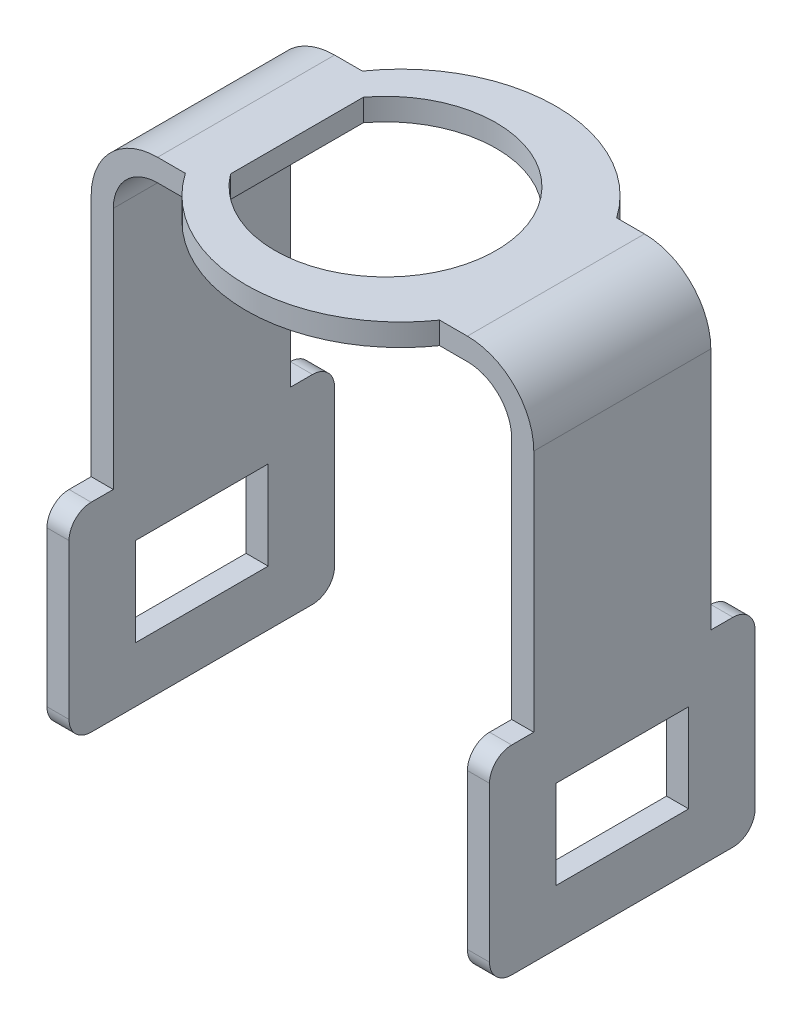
ISO-10303-21;
HEADER;
FILE_DESCRIPTION(('STEP AP214'),'2;1');
FILE_NAME('part.step','',(''),(''),'','','');
FILE_SCHEMA(('AUTOMOTIVE_DESIGN { 1 0 10303 214 1 1 1 1 }'));
ENDSEC;
DATA;
#1=APPLICATION_CONTEXT('core data for automotive mechanical design processes');
#2=APPLICATION_PROTOCOL_DEFINITION('international standard','automotive_design',2000,#1);
#3=PRODUCT_CONTEXT('',#1,'mechanical');
#4=PRODUCT('Part','Part','',(#3));
#5=PRODUCT_RELATED_PRODUCT_CATEGORY('part','',(#4));
#6=PRODUCT_DEFINITION_FORMATION('','',#4);
#7=PRODUCT_DEFINITION_CONTEXT('part definition',#1,'design');
#8=PRODUCT_DEFINITION('design','',#6,#7);
#9=PRODUCT_DEFINITION_SHAPE('','',#8);
#10=(LENGTH_UNIT() NAMED_UNIT(*) SI_UNIT(.MILLI.,.METRE.));
#11=(NAMED_UNIT(*) PLANE_ANGLE_UNIT() SI_UNIT($,.RADIAN.));
#12=(NAMED_UNIT(*) SI_UNIT($,.STERADIAN.) SOLID_ANGLE_UNIT());
#13=UNCERTAINTY_MEASURE_WITH_UNIT(LENGTH_MEASURE(1.E-05),#10,'distance_accuracy_value','');
#14=(GEOMETRIC_REPRESENTATION_CONTEXT(3) GLOBAL_UNCERTAINTY_ASSIGNED_CONTEXT((#13)) GLOBAL_UNIT_ASSIGNED_CONTEXT((#10,
#11,#12)) REPRESENTATION_CONTEXT('',''));
#15=CARTESIAN_POINT('',(0.,0.,0.));
#16=DIRECTION('',(0.,0.,1.));
#17=DIRECTION('',(1.,0.,0.));
#18=AXIS2_PLACEMENT_3D('',#15,#16,#17);
#19=CARTESIAN_POINT('',(-9.00000000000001,-5.,-3.));
#20=DIRECTION('',(0.,0.,-1.));
#21=DIRECTION('',(0.,1.,0.));
#22=AXIS2_PLACEMENT_3D('',#19,#20,#21);
#23=PLANE('',#22);
#24=DIRECTION('',(1.,0.,0.));
#25=VECTOR('',#24,1.);
#26=CARTESIAN_POINT('',(-9.00000000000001,-9.,-3.));
#27=LINE('',#26,#25);
#28=CARTESIAN_POINT('',(-10.,-9.,-3.));
#29=VERTEX_POINT('',#28);
#30=CARTESIAN_POINT('',(-9.00000000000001,-9.,-3.));
#31=VERTEX_POINT('',#30);
#32=EDGE_CURVE('E355',#29,#31,#27,.T.);
#33=ORIENTED_EDGE('',*,*,#32,.T.);
#34=DIRECTION('',(0.,1.,0.));
#35=VECTOR('',#34,1.);
#36=CARTESIAN_POINT('',(-9.00000000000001,8.49999999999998,-3.));
#37=LINE('',#36,#35);
#38=CARTESIAN_POINT('',(-9.00000000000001,-5.,-3.));
#39=VERTEX_POINT('',#38);
#40=EDGE_CURVE('E315',#39,#31,#37,.F.);
#41=ORIENTED_EDGE('',*,*,#40,.F.);
#42=DIRECTION('',(-1.,0.,0.));
#43=VECTOR('',#42,1.);
#44=CARTESIAN_POINT('',(-9.00000000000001,-5.,-3.));
#45=LINE('',#44,#43);
#46=CARTESIAN_POINT('',(-10.,-5.,-3.));
#47=VERTEX_POINT('',#46);
#48=EDGE_CURVE('E347',#39,#47,#45,.T.);
#49=ORIENTED_EDGE('',*,*,#48,.T.);
#50=DIRECTION('',(0.,1.,0.));
#51=VECTOR('',#50,1.);
#52=CARTESIAN_POINT('',(-10.,8.49999999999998,-3.));
#53=LINE('',#52,#51);
#54=EDGE_CURVE('E488',#47,#29,#53,.F.);
#55=ORIENTED_EDGE('',*,*,#54,.T.);
#56=EDGE_LOOP('',(#33,#41,#49,#55));
#57=FACE_BOUND('',#56,.T.);
#58=ADVANCED_FACE('F14',(#57),#23,.F.);
#59=CARTESIAN_POINT('',(-9.00000000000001,-9.,-3.));
#60=DIRECTION('',(0.,-1.,0.));
#61=DIRECTION('',(1.,0.,0.));
#62=AXIS2_PLACEMENT_3D('',#59,#60,#61);
#63=PLANE('',#62);
#64=DIRECTION('',(1.,0.,0.));
#65=VECTOR('',#64,1.);
#66=CARTESIAN_POINT('',(-9.00000000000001,-9.,3.));
#67=LINE('',#66,#65);
#68=CARTESIAN_POINT('',(-10.,-9.,3.));
#69=VERTEX_POINT('',#68);
#70=CARTESIAN_POINT('',(-9.00000000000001,-9.,3.));
#71=VERTEX_POINT('',#70);
#72=EDGE_CURVE('E353',#69,#71,#67,.T.);
#73=ORIENTED_EDGE('',*,*,#72,.T.);
#74=DIRECTION('',(0.,0.,1.));
#75=VECTOR('',#74,1.);
#76=CARTESIAN_POINT('',(-9.00000000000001,-9.,4.));
#77=LINE('',#76,#75);
#78=EDGE_CURVE('E312',#31,#71,#77,.T.);
#79=ORIENTED_EDGE('',*,*,#78,.F.);
#80=ORIENTED_EDGE('',*,*,#32,.F.);
#81=DIRECTION('',(0.,0.,1.));
#82=VECTOR('',#81,1.);
#83=CARTESIAN_POINT('',(-10.,-9.,4.));
#84=LINE('',#83,#82);
#85=EDGE_CURVE('E496',#29,#69,#84,.T.);
#86=ORIENTED_EDGE('',*,*,#85,.T.);
#87=EDGE_LOOP('',(#73,#79,#80,#86));
#88=FACE_BOUND('',#87,.T.);
#89=ADVANCED_FACE('F828',(#88),#63,.F.);
#90=CARTESIAN_POINT('',(-9.00000000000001,-5.,3.));
#91=DIRECTION('',(0.,0.,1.));
#92=DIRECTION('',(1.,0.,0.));
#93=AXIS2_PLACEMENT_3D('',#90,#91,#92);
#94=PLANE('',#93);
#95=DIRECTION('',(-1.,0.,0.));
#96=VECTOR('',#95,1.);
#97=CARTESIAN_POINT('',(-9.00000000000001,-5.,3.));
#98=LINE('',#97,#96);
#99=CARTESIAN_POINT('',(-10.,-5.,3.));
#100=VERTEX_POINT('',#99);
#101=CARTESIAN_POINT('',(-9.00000000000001,-5.,3.));
#102=VERTEX_POINT('',#101);
#103=EDGE_CURVE('E350',#100,#102,#98,.F.);
#104=ORIENTED_EDGE('',*,*,#103,.T.);
#105=DIRECTION('',(0.,1.,0.));
#106=VECTOR('',#105,1.);
#107=CARTESIAN_POINT('',(-9.00000000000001,8.49999999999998,3.));
#108=LINE('',#107,#106);
#109=EDGE_CURVE('E320',#71,#102,#108,.T.);
#110=ORIENTED_EDGE('',*,*,#109,.F.);
#111=ORIENTED_EDGE('',*,*,#72,.F.);
#112=DIRECTION('',(0.,1.,0.));
#113=VECTOR('',#112,1.);
#114=CARTESIAN_POINT('',(-10.,8.49999999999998,3.));
#115=LINE('',#114,#113);
#116=EDGE_CURVE('E499',#69,#100,#115,.T.);
#117=ORIENTED_EDGE('',*,*,#116,.T.);
#118=EDGE_LOOP('',(#104,#110,#111,#117));
#119=FACE_BOUND('',#118,.T.);
#120=ADVANCED_FACE('F825',(#119),#94,.F.);
#121=CARTESIAN_POINT('',(-9.00000000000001,-5.,-3.));
#122=DIRECTION('',(0.,1.,0.));
#123=DIRECTION('',(-1.,0.,0.));
#124=AXIS2_PLACEMENT_3D('',#121,#122,#123);
#125=PLANE('',#124);
#126=ORIENTED_EDGE('',*,*,#48,.F.);
#127=DIRECTION('',(0.,0.,1.));
#128=VECTOR('',#127,1.);
#129=CARTESIAN_POINT('',(-9.00000000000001,-5.,4.));
#130=LINE('',#129,#128);
#131=EDGE_CURVE('E317',#102,#39,#130,.F.);
#132=ORIENTED_EDGE('',*,*,#131,.F.);
#133=ORIENTED_EDGE('',*,*,#103,.F.);
#134=DIRECTION('',(0.,0.,1.));
#135=VECTOR('',#134,1.);
#136=CARTESIAN_POINT('',(-10.,-5.,4.));
#137=LINE('',#136,#135);
#138=EDGE_CURVE('E460',#100,#47,#137,.F.);
#139=ORIENTED_EDGE('',*,*,#138,.T.);
#140=EDGE_LOOP('',(#126,#132,#133,#139));
#141=FACE_BOUND('',#140,.T.);
#142=ADVANCED_FACE('F821',(#141),#125,.F.);
#143=CARTESIAN_POINT('',(-9.00000000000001,-3.5,-5.));
#144=DIRECTION('',(-1.,0.,0.));
#145=DIRECTION('',(0.,-1.,0.));
#146=AXIS2_PLACEMENT_3D('',#143,#144,#145);
#147=CYLINDRICAL_SURFACE('',#146,1.);
#148=CARTESIAN_POINT('',(-10.,-3.5,-5.));
#149=DIRECTION('',(-1.,0.,0.));
#150=DIRECTION('',(0.,-1.,0.));
#151=AXIS2_PLACEMENT_3D('',#148,#149,#150);
#152=CIRCLE('',#151,1.);
#153=CARTESIAN_POINT('',(-10.,-3.5,-6.));
#154=VERTEX_POINT('',#153);
#155=CARTESIAN_POINT('',(-10.,-2.5,-5.));
#156=VERTEX_POINT('',#155);
#157=EDGE_CURVE('E456',#154,#156,#152,.F.);
#158=ORIENTED_EDGE('',*,*,#157,.T.);
#159=DIRECTION('',(-1.,0.,0.));
#160=VECTOR('',#159,1.);
#161=CARTESIAN_POINT('',(-9.00000000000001,-2.5,-5.));
#162=LINE('',#161,#160);
#163=CARTESIAN_POINT('',(-9.00000000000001,-2.5,-5.));
#164=VERTEX_POINT('',#163);
#165=EDGE_CURVE('E337',#164,#156,#162,.T.);
#166=ORIENTED_EDGE('',*,*,#165,.F.);
#167=CARTESIAN_POINT('',(-9.00000000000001,-3.5,-5.));
#168=DIRECTION('',(-1.,0.,0.));
#169=DIRECTION('',(0.,-1.,0.));
#170=AXIS2_PLACEMENT_3D('',#167,#168,#169);
#171=CIRCLE('',#170,1.);
#172=CARTESIAN_POINT('',(-9.00000000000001,-3.5,-6.));
#173=VERTEX_POINT('',#172);
#174=EDGE_CURVE('E304',#173,#164,#171,.F.);
#175=ORIENTED_EDGE('',*,*,#174,.F.);
#176=DIRECTION('',(-1.,0.,0.));
#177=VECTOR('',#176,1.);
#178=CARTESIAN_POINT('',(-9.00000000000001,-3.5,-6.));
#179=LINE('',#178,#177);
#180=EDGE_CURVE('E299',#154,#173,#179,.F.);
#181=ORIENTED_EDGE('',*,*,#180,.F.);
#182=EDGE_LOOP('',(#158,#166,#175,#181));
#183=FACE_BOUND('',#182,.T.);
#184=ADVANCED_FACE('F817',(#183),#147,.T.);
#185=CARTESIAN_POINT('',(-9.00000000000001,-2.5,-6.));
#186=DIRECTION('',(0.,1.,0.));
#187=DIRECTION('',(-1.,0.,0.));
#188=AXIS2_PLACEMENT_3D('',#185,#186,#187);
#189=PLANE('',#188);
#190=DIRECTION('',(0.,0.,1.));
#191=VECTOR('',#190,1.);
#192=CARTESIAN_POINT('',(-10.,-2.5,4.));
#193=LINE('',#192,#191);
#194=CARTESIAN_POINT('',(-10.,-2.5,-4.));
#195=VERTEX_POINT('',#194);
#196=EDGE_CURVE('E459',#156,#195,#193,.T.);
#197=ORIENTED_EDGE('',*,*,#196,.T.);
#198=DIRECTION('',(1.,0.,0.));
#199=VECTOR('',#198,1.);
#200=CARTESIAN_POINT('',(-7.00000000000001,-2.5,-4.));
#201=LINE('',#200,#199);
#202=CARTESIAN_POINT('',(-9.00000000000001,-2.5,-4.));
#203=VERTEX_POINT('',#202);
#204=EDGE_CURVE('E339',#195,#203,#201,.T.);
#205=ORIENTED_EDGE('',*,*,#204,.T.);
#206=DIRECTION('',(0.,0.,1.));
#207=VECTOR('',#206,1.);
#208=CARTESIAN_POINT('',(-9.00000000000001,-2.5,4.));
#209=LINE('',#208,#207);
#210=EDGE_CURVE('E306',#164,#203,#209,.T.);
#211=ORIENTED_EDGE('',*,*,#210,.F.);
#212=ORIENTED_EDGE('',*,*,#165,.T.);
#213=EDGE_LOOP('',(#197,#205,#211,#212));
#214=FACE_BOUND('',#213,.T.);
#215=ADVANCED_FACE('F813',(#214),#189,.T.);
#216=CARTESIAN_POINT('',(-9.00000000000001,-3.5,5.));
#217=DIRECTION('',(-1.,0.,0.));
#218=DIRECTION('',(0.,-1.,0.));
#219=AXIS2_PLACEMENT_3D('',#216,#217,#218);
#220=CYLINDRICAL_SURFACE('',#219,1.);
#221=CARTESIAN_POINT('',(-10.,-3.5,5.));
#222=DIRECTION('',(-1.,0.,0.));
#223=DIRECTION('',(0.,-1.,0.));
#224=AXIS2_PLACEMENT_3D('',#221,#222,#223);
#225=CIRCLE('',#224,1.);
#226=CARTESIAN_POINT('',(-10.,-2.5,5.));
#227=VERTEX_POINT('',#226);
#228=CARTESIAN_POINT('',(-10.,-3.5,6.));
#229=VERTEX_POINT('',#228);
#230=EDGE_CURVE('E452',#227,#229,#225,.F.);
#231=ORIENTED_EDGE('',*,*,#230,.T.);
#232=DIRECTION('',(1.,0.,0.));
#233=VECTOR('',#232,1.);
#234=CARTESIAN_POINT('',(-9.00000000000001,-3.5,6.));
#235=LINE('',#234,#233);
#236=CARTESIAN_POINT('',(-9.00000000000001,-3.5,6.));
#237=VERTEX_POINT('',#236);
#238=EDGE_CURVE('E335',#237,#229,#235,.F.);
#239=ORIENTED_EDGE('',*,*,#238,.F.);
#240=CARTESIAN_POINT('',(-9.00000000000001,-3.5,5.));
#241=DIRECTION('',(-1.,0.,0.));
#242=DIRECTION('',(0.,-1.,0.));
#243=AXIS2_PLACEMENT_3D('',#240,#241,#242);
#244=CIRCLE('',#243,1.);
#245=CARTESIAN_POINT('',(-9.00000000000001,-2.5,5.));
#246=VERTEX_POINT('',#245);
#247=EDGE_CURVE('E463',#246,#237,#244,.F.);
#248=ORIENTED_EDGE('',*,*,#247,.F.);
#249=DIRECTION('',(-1.,0.,0.));
#250=VECTOR('',#249,1.);
#251=CARTESIAN_POINT('',(-9.00000000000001,-2.5,5.));
#252=LINE('',#251,#250);
#253=EDGE_CURVE('E322',#227,#246,#252,.F.);
#254=ORIENTED_EDGE('',*,*,#253,.F.);
#255=EDGE_LOOP('',(#231,#239,#248,#254));
#256=FACE_BOUND('',#255,.T.);
#257=ADVANCED_FACE('F809',(#256),#220,.T.);
#258=CARTESIAN_POINT('',(-9.00000000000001,-11.5,6.));
#259=DIRECTION('',(0.,0.,1.));
#260=DIRECTION('',(1.,0.,0.));
#261=AXIS2_PLACEMENT_3D('',#258,#259,#260);
#262=PLANE('',#261);
#263=DIRECTION('',(0.,1.,0.));
#264=VECTOR('',#263,1.);
#265=CARTESIAN_POINT('',(-9.00000000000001,8.49999999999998,6.));
#266=LINE('',#265,#264);
#267=CARTESIAN_POINT('',(-9.00000000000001,-10.5,6.));
#268=VERTEX_POINT('',#267);
#269=EDGE_CURVE('E462',#237,#268,#266,.F.);
#270=ORIENTED_EDGE('',*,*,#269,.F.);
#271=ORIENTED_EDGE('',*,*,#238,.T.);
#272=DIRECTION('',(0.,1.,0.));
#273=VECTOR('',#272,1.);
#274=CARTESIAN_POINT('',(-10.,8.49999999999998,6.));
#275=LINE('',#274,#273);
#276=CARTESIAN_POINT('',(-10.,-10.5,6.));
#277=VERTEX_POINT('',#276);
#278=EDGE_CURVE('E451',#229,#277,#275,.F.);
#279=ORIENTED_EDGE('',*,*,#278,.T.);
#280=DIRECTION('',(-1.,0.,0.));
#281=VECTOR('',#280,1.);
#282=CARTESIAN_POINT('',(-9.00000000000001,-10.5,6.));
#283=LINE('',#282,#281);
#284=EDGE_CURVE('E333',#268,#277,#283,.T.);
#285=ORIENTED_EDGE('',*,*,#284,.F.);
#286=EDGE_LOOP('',(#270,#271,#279,#285));
#287=FACE_BOUND('',#286,.T.);
#288=ADVANCED_FACE('F805',(#287),#262,.T.);
#289=CARTESIAN_POINT('',(-9.00000000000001,-10.5,5.));
#290=DIRECTION('',(-1.,0.,0.));
#291=DIRECTION('',(0.,-1.,0.));
#292=AXIS2_PLACEMENT_3D('',#289,#290,#291);
#293=CYLINDRICAL_SURFACE('',#292,1.);
#294=CARTESIAN_POINT('',(-10.,-10.5,5.));
#295=DIRECTION('',(-1.,0.,0.));
#296=DIRECTION('',(0.,-1.,0.));
#297=AXIS2_PLACEMENT_3D('',#294,#295,#296);
#298=CIRCLE('',#297,1.);
#299=CARTESIAN_POINT('',(-10.,-11.5,5.));
#300=VERTEX_POINT('',#299);
#301=EDGE_CURVE('E448',#277,#300,#298,.F.);
#302=ORIENTED_EDGE('',*,*,#301,.T.);
#303=DIRECTION('',(1.,0.,0.));
#304=VECTOR('',#303,1.);
#305=CARTESIAN_POINT('',(-9.00000000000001,-11.5,5.));
#306=LINE('',#305,#304);
#307=CARTESIAN_POINT('',(-9.00000000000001,-11.5,5.));
#308=VERTEX_POINT('',#307);
#309=EDGE_CURVE('E331',#308,#300,#306,.F.);
#310=ORIENTED_EDGE('',*,*,#309,.F.);
#311=CARTESIAN_POINT('',(-9.00000000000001,-10.5,5.));
#312=DIRECTION('',(-1.,0.,0.));
#313=DIRECTION('',(0.,-1.,0.));
#314=AXIS2_PLACEMENT_3D('',#311,#312,#313);
#315=CIRCLE('',#314,1.);
#316=EDGE_CURVE('E343',#268,#308,#315,.F.);
#317=ORIENTED_EDGE('',*,*,#316,.F.);
#318=ORIENTED_EDGE('',*,*,#284,.T.);
#319=EDGE_LOOP('',(#302,#310,#317,#318));
#320=FACE_BOUND('',#319,.T.);
#321=ADVANCED_FACE('F801',(#320),#293,.T.);
#322=CARTESIAN_POINT('',(-9.00000000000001,-11.5,4.));
#323=DIRECTION('',(0.,-1.,0.));
#324=DIRECTION('',(1.,0.,0.));
#325=AXIS2_PLACEMENT_3D('',#322,#323,#324);
#326=PLANE('',#325);
#327=DIRECTION('',(0.,0.,1.));
#328=VECTOR('',#327,1.);
#329=CARTESIAN_POINT('',(-9.00000000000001,-11.5,4.));
#330=LINE('',#329,#328);
#331=CARTESIAN_POINT('',(-9.00000000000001,-11.5,-5.));
#332=VERTEX_POINT('',#331);
#333=EDGE_CURVE('E280',#308,#332,#330,.F.);
#334=ORIENTED_EDGE('',*,*,#333,.F.);
#335=ORIENTED_EDGE('',*,*,#309,.T.);
#336=DIRECTION('',(0.,0.,1.));
#337=VECTOR('',#336,1.);
#338=CARTESIAN_POINT('',(-10.,-11.5,4.));
#339=LINE('',#338,#337);
#340=CARTESIAN_POINT('',(-10.,-11.5,-5.));
#341=VERTEX_POINT('',#340);
#342=EDGE_CURVE('E447',#300,#341,#339,.F.);
#343=ORIENTED_EDGE('',*,*,#342,.T.);
#344=DIRECTION('',(-1.,0.,0.));
#345=VECTOR('',#344,1.);
#346=CARTESIAN_POINT('',(-9.00000000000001,-11.5,-5.));
#347=LINE('',#346,#345);
#348=EDGE_CURVE('E300',#332,#341,#347,.T.);
#349=ORIENTED_EDGE('',*,*,#348,.F.);
#350=EDGE_LOOP('',(#334,#335,#343,#349));
#351=FACE_BOUND('',#350,.T.);
#352=ADVANCED_FACE('F798',(#351),#326,.T.);
#353=CARTESIAN_POINT('',(-9.00000000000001,-10.5,-5.));
#354=DIRECTION('',(-1.,0.,0.));
#355=DIRECTION('',(0.,-1.,0.));
#356=AXIS2_PLACEMENT_3D('',#353,#354,#355);
#357=CYLINDRICAL_SURFACE('',#356,1.);
#358=CARTESIAN_POINT('',(-10.,-10.5,-5.));
#359=DIRECTION('',(-1.,0.,0.));
#360=DIRECTION('',(0.,-1.,0.));
#361=AXIS2_PLACEMENT_3D('',#358,#359,#360);
#362=CIRCLE('',#361,1.);
#363=CARTESIAN_POINT('',(-10.,-10.5,-6.));
#364=VERTEX_POINT('',#363);
#365=EDGE_CURVE('E295',#341,#364,#362,.F.);
#366=ORIENTED_EDGE('',*,*,#365,.T.);
#367=DIRECTION('',(-1.,0.,0.));
#368=VECTOR('',#367,1.);
#369=CARTESIAN_POINT('',(-9.00000000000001,-10.5,-6.));
#370=LINE('',#369,#368);
#371=CARTESIAN_POINT('',(-9.00000000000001,-10.5,-6.));
#372=VERTEX_POINT('',#371);
#373=EDGE_CURVE('E292',#372,#364,#370,.T.);
#374=ORIENTED_EDGE('',*,*,#373,.F.);
#375=CARTESIAN_POINT('',(-9.00000000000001,-10.5,-5.));
#376=DIRECTION('',(-1.,0.,0.));
#377=DIRECTION('',(0.,-1.,0.));
#378=AXIS2_PLACEMENT_3D('',#375,#376,#377);
#379=CIRCLE('',#378,1.);
#380=EDGE_CURVE('E17',#332,#372,#379,.F.);
#381=ORIENTED_EDGE('',*,*,#380,.F.);
#382=ORIENTED_EDGE('',*,*,#348,.T.);
#383=EDGE_LOOP('',(#366,#374,#381,#382));
#384=FACE_BOUND('',#383,.T.);
#385=ADVANCED_FACE('F293',(#384),#357,.T.);
#386=CARTESIAN_POINT('',(-9.00000000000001,-11.5,-6.));
#387=DIRECTION('',(0.,0.,-1.));
#388=DIRECTION('',(-1.,0.,0.));
#389=AXIS2_PLACEMENT_3D('',#386,#387,#388);
#390=PLANE('',#389);
#391=DIRECTION('',(0.,1.,0.));
#392=VECTOR('',#391,1.);
#393=CARTESIAN_POINT('',(-10.,8.49999999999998,-6.));
#394=LINE('',#393,#392);
#395=EDGE_CURVE('E446',#364,#154,#394,.T.);
#396=ORIENTED_EDGE('',*,*,#395,.T.);
#397=ORIENTED_EDGE('',*,*,#180,.T.);
#398=DIRECTION('',(0.,1.,0.));
#399=VECTOR('',#398,1.);
#400=CARTESIAN_POINT('',(-9.00000000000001,8.49999999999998,-6.));
#401=LINE('',#400,#399);
#402=EDGE_CURVE('E288',#372,#173,#401,.T.);
#403=ORIENTED_EDGE('',*,*,#402,.F.);
#404=ORIENTED_EDGE('',*,*,#373,.T.);
#405=EDGE_LOOP('',(#396,#397,#403,#404));
#406=FACE_BOUND('',#405,.T.);
#407=ADVANCED_FACE('F302',(#406),#390,.T.);
#408=CARTESIAN_POINT('',(-9.00000000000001,-2.5,-6.));
#409=DIRECTION('',(0.,1.,0.));
#410=DIRECTION('',(-1.,0.,0.));
#411=AXIS2_PLACEMENT_3D('',#408,#409,#410);
#412=PLANE('',#411);
#413=DIRECTION('',(0.,0.,1.));
#414=VECTOR('',#413,1.);
#415=CARTESIAN_POINT('',(-9.00000000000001,-2.5,4.));
#416=LINE('',#415,#414);
#417=CARTESIAN_POINT('',(-9.00000000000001,-2.5,4.));
#418=VERTEX_POINT('',#417);
#419=EDGE_CURVE('E464',#418,#246,#416,.T.);
#420=ORIENTED_EDGE('',*,*,#419,.F.);
#421=DIRECTION('',(1.,0.,0.));
#422=VECTOR('',#421,1.);
#423=CARTESIAN_POINT('',(-7.00000000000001,-2.5,4.));
#424=LINE('',#423,#422);
#425=CARTESIAN_POINT('',(-10.,-2.5,4.));
#426=VERTEX_POINT('',#425);
#427=EDGE_CURVE('E323',#426,#418,#424,.T.);
#428=ORIENTED_EDGE('',*,*,#427,.F.);
#429=DIRECTION('',(0.,0.,1.));
#430=VECTOR('',#429,1.);
#431=CARTESIAN_POINT('',(-10.,-2.5,4.));
#432=LINE('',#431,#430);
#433=EDGE_CURVE('E455',#426,#227,#432,.T.);
#434=ORIENTED_EDGE('',*,*,#433,.T.);
#435=ORIENTED_EDGE('',*,*,#253,.T.);
#436=EDGE_LOOP('',(#420,#428,#434,#435));
#437=FACE_BOUND('',#436,.T.);
#438=ADVANCED_FACE('F790',(#437),#412,.T.);
#439=CARTESIAN_POINT('',(-9.00000000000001,8.49999999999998,4.));
#440=DIRECTION('',(1.,0.,0.));
#441=DIRECTION('',(0.,1.,0.));
#442=AXIS2_PLACEMENT_3D('',#439,#440,#441);
#443=PLANE('',#442);
#444=ORIENTED_EDGE('',*,*,#269,.T.);
#445=ORIENTED_EDGE('',*,*,#316,.T.);
#446=ORIENTED_EDGE('',*,*,#333,.T.);
#447=ORIENTED_EDGE('',*,*,#380,.T.);
#448=ORIENTED_EDGE('',*,*,#402,.T.);
#449=ORIENTED_EDGE('',*,*,#174,.T.);
#450=ORIENTED_EDGE('',*,*,#210,.T.);
#451=DIRECTION('',(0.,1.,0.));
#452=VECTOR('',#451,1.);
#453=CARTESIAN_POINT('',(-9.00000000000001,8.5,-4.));
#454=LINE('',#453,#452);
#455=CARTESIAN_POINT('',(-9.00000000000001,8.5,-4.));
#456=VERTEX_POINT('',#455);
#457=EDGE_CURVE('E342',#203,#456,#454,.T.);
#458=ORIENTED_EDGE('',*,*,#457,.T.);
#459=DIRECTION('',(0.,0.,-1.));
#460=VECTOR('',#459,1.);
#461=CARTESIAN_POINT('',(-9.00000000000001,8.5,4.));
#462=LINE('',#461,#460);
#463=CARTESIAN_POINT('',(-9.00000000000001,8.5,4.));
#464=VERTEX_POINT('',#463);
#465=EDGE_CURVE('E444',#456,#464,#462,.F.);
#466=ORIENTED_EDGE('',*,*,#465,.T.);
#467=DIRECTION('',(0.,1.,0.));
#468=VECTOR('',#467,1.);
#469=CARTESIAN_POINT('',(-9.00000000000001,8.5,4.));
#470=LINE('',#469,#468);
#471=EDGE_CURVE('E325',#418,#464,#470,.T.);
#472=ORIENTED_EDGE('',*,*,#471,.F.);
#473=ORIENTED_EDGE('',*,*,#419,.T.);
#474=ORIENTED_EDGE('',*,*,#247,.T.);
#475=EDGE_LOOP('',(#444,#445,#446,#447,#448,#449,#450,#458,#466,#472,#473,#474));
#476=FACE_BOUND('',#475,.T.);
#477=ORIENTED_EDGE('',*,*,#40,.T.);
#478=ORIENTED_EDGE('',*,*,#78,.T.);
#479=ORIENTED_EDGE('',*,*,#109,.T.);
#480=ORIENTED_EDGE('',*,*,#131,.T.);
#481=EDGE_LOOP('',(#477,#478,#479,#480));
#482=FACE_BOUND('',#481,.T.);
#483=ADVANCED_FACE('F285',(#476,#482),#443,.T.);
#484=CARTESIAN_POINT('',(-7.00000000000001,8.5,-4.));
#485=DIRECTION('',(0.,0.,1.));
#486=DIRECTION('',(1.,0.,0.));
#487=AXIS2_PLACEMENT_3D('',#484,#485,#486);
#488=PLANE('',#487);
#489=DIRECTION('',(0.,1.,0.));
#490=VECTOR('',#489,1.);
#491=CARTESIAN_POINT('',(-5.74456264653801,10.5,-4.));
#492=LINE('',#491,#490);
#493=CARTESIAN_POINT('',(-5.74456264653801,10.5,-4.));
#494=VERTEX_POINT('',#493);
#495=CARTESIAN_POINT('',(-5.74456264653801,11.5,-4.));
#496=VERTEX_POINT('',#495);
#497=EDGE_CURVE('E538',#494,#496,#492,.T.);
#498=ORIENTED_EDGE('',*,*,#497,.F.);
#499=DIRECTION('',(1.,0.,0.));
#500=VECTOR('',#499,1.);
#501=CARTESIAN_POINT('',(-7.00000000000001,10.5,-4.));
#502=LINE('',#501,#500);
#503=CARTESIAN_POINT('',(-7.,10.5,-4.));
#504=VERTEX_POINT('',#503);
#505=EDGE_CURVE('E484',#504,#494,#502,.T.);
#506=ORIENTED_EDGE('',*,*,#505,.F.);
#507=CARTESIAN_POINT('',(-7.00000000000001,8.5,-4.));
#508=DIRECTION('',(0.,0.,-1.));
#509=DIRECTION('',(-1.,0.,0.));
#510=AXIS2_PLACEMENT_3D('',#507,#508,#509);
#511=CIRCLE('',#510,2.);
#512=EDGE_CURVE('E437',#504,#456,#511,.F.);
#513=ORIENTED_EDGE('',*,*,#512,.T.);
#514=ORIENTED_EDGE('',*,*,#457,.F.);
#515=ORIENTED_EDGE('',*,*,#204,.F.);
#516=DIRECTION('',(0.,1.,0.));
#517=VECTOR('',#516,1.);
#518=CARTESIAN_POINT('',(-10.,8.49999999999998,-4.));
#519=LINE('',#518,#517);
#520=CARTESIAN_POINT('',(-10.,8.5,-4.));
#521=VERTEX_POINT('',#520);
#522=EDGE_CURVE('E491',#195,#521,#519,.T.);
#523=ORIENTED_EDGE('',*,*,#522,.T.);
#524=CARTESIAN_POINT('',(-7.00000000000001,8.5,-4.));
#525=DIRECTION('',(0.,0.,-1.));
#526=DIRECTION('',(-1.,0.,0.));
#527=AXIS2_PLACEMENT_3D('',#524,#525,#526);
#528=CIRCLE('',#527,3.);
#529=CARTESIAN_POINT('',(-7.,11.5,-4.));
#530=VERTEX_POINT('',#529);
#531=EDGE_CURVE('E434',#530,#521,#528,.F.);
#532=ORIENTED_EDGE('',*,*,#531,.F.);
#533=DIRECTION('',(1.,0.,0.));
#534=VECTOR('',#533,1.);
#535=CARTESIAN_POINT('',(-7.00000000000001,11.5,-4.));
#536=LINE('',#535,#534);
#537=EDGE_CURVE('E486',#496,#530,#536,.F.);
#538=ORIENTED_EDGE('',*,*,#537,.F.);
#539=EDGE_LOOP('',(#498,#506,#513,#514,#515,#523,#532,#538));
#540=FACE_BOUND('',#539,.T.);
#541=ADVANCED_FACE('F783',(#540),#488,.F.);
#542=CARTESIAN_POINT('',(-10.,8.49999999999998,4.));
#543=DIRECTION('',(1.,0.,0.));
#544=DIRECTION('',(0.,1.,0.));
#545=AXIS2_PLACEMENT_3D('',#542,#543,#544);
#546=PLANE('',#545);
#547=ORIENTED_EDGE('',*,*,#365,.F.);
#548=ORIENTED_EDGE('',*,*,#342,.F.);
#549=ORIENTED_EDGE('',*,*,#301,.F.);
#550=ORIENTED_EDGE('',*,*,#278,.F.);
#551=ORIENTED_EDGE('',*,*,#230,.F.);
#552=ORIENTED_EDGE('',*,*,#433,.F.);
#553=DIRECTION('',(0.,1.,0.));
#554=VECTOR('',#553,1.);
#555=CARTESIAN_POINT('',(-10.,8.5,4.));
#556=LINE('',#555,#554);
#557=CARTESIAN_POINT('',(-10.,8.5,4.));
#558=VERTEX_POINT('',#557);
#559=EDGE_CURVE('E326',#558,#426,#556,.F.);
#560=ORIENTED_EDGE('',*,*,#559,.F.);
#561=DIRECTION('',(0.,0.,-1.));
#562=VECTOR('',#561,1.);
#563=CARTESIAN_POINT('',(-10.,8.5,4.));
#564=LINE('',#563,#562);
#565=EDGE_CURVE('E433',#521,#558,#564,.F.);
#566=ORIENTED_EDGE('',*,*,#565,.F.);
#567=ORIENTED_EDGE('',*,*,#522,.F.);
#568=ORIENTED_EDGE('',*,*,#196,.F.);
#569=ORIENTED_EDGE('',*,*,#157,.F.);
#570=ORIENTED_EDGE('',*,*,#395,.F.);
#571=EDGE_LOOP('',(#547,#548,#549,#550,#551,#552,#560,#566,#567,#568,#569,#570));
#572=FACE_BOUND('',#571,.T.);
#573=ORIENTED_EDGE('',*,*,#116,.F.);
#574=ORIENTED_EDGE('',*,*,#85,.F.);
#575=ORIENTED_EDGE('',*,*,#54,.F.);
#576=ORIENTED_EDGE('',*,*,#138,.F.);
#577=EDGE_LOOP('',(#573,#574,#575,#576));
#578=FACE_BOUND('',#577,.T.);
#579=ADVANCED_FACE('F779',(#572,#578),#546,.F.);
#580=CARTESIAN_POINT('',(-7.00000000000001,8.5,4.));
#581=DIRECTION('',(0.,0.,1.));
#582=DIRECTION('',(1.,0.,0.));
#583=AXIS2_PLACEMENT_3D('',#580,#581,#582);
#584=PLANE('',#583);
#585=CARTESIAN_POINT('',(-7.00000000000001,8.5,4.));
#586=DIRECTION('',(0.,0.,-1.));
#587=DIRECTION('',(-1.,0.,0.));
#588=AXIS2_PLACEMENT_3D('',#585,#586,#587);
#589=CIRCLE('',#588,2.);
#590=CARTESIAN_POINT('',(-7.,10.5,4.));
#591=VERTEX_POINT('',#590);
#592=EDGE_CURVE('E441',#464,#591,#589,.T.);
#593=ORIENTED_EDGE('',*,*,#592,.T.);
#594=DIRECTION('',(1.,0.,0.));
#595=VECTOR('',#594,1.);
#596=CARTESIAN_POINT('',(-7.00000000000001,10.5,4.));
#597=LINE('',#596,#595);
#598=CARTESIAN_POINT('',(-5.74456264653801,10.5,4.));
#599=VERTEX_POINT('',#598);
#600=EDGE_CURVE('E477',#591,#599,#597,.T.);
#601=ORIENTED_EDGE('',*,*,#600,.T.);
#602=DIRECTION('',(0.,1.,0.));
#603=VECTOR('',#602,1.);
#604=CARTESIAN_POINT('',(-5.74456264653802,10.5,4.));
#605=LINE('',#604,#603);
#606=CARTESIAN_POINT('',(-5.74456264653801,11.5,4.));
#607=VERTEX_POINT('',#606);
#608=EDGE_CURVE('E436',#607,#599,#605,.F.);
#609=ORIENTED_EDGE('',*,*,#608,.F.);
#610=DIRECTION('',(1.,0.,0.));
#611=VECTOR('',#610,1.);
#612=CARTESIAN_POINT('',(-7.00000000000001,11.5,4.));
#613=LINE('',#612,#611);
#614=CARTESIAN_POINT('',(-7.,11.5,4.));
#615=VERTEX_POINT('',#614);
#616=EDGE_CURVE('E517',#607,#615,#613,.F.);
#617=ORIENTED_EDGE('',*,*,#616,.T.);
#618=CARTESIAN_POINT('',(-7.00000000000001,8.5,4.));
#619=DIRECTION('',(0.,0.,-1.));
#620=DIRECTION('',(-1.,0.,0.));
#621=AXIS2_PLACEMENT_3D('',#618,#619,#620);
#622=CIRCLE('',#621,3.);
#623=EDGE_CURVE('E430',#558,#615,#622,.T.);
#624=ORIENTED_EDGE('',*,*,#623,.F.);
#625=ORIENTED_EDGE('',*,*,#559,.T.);
#626=ORIENTED_EDGE('',*,*,#427,.T.);
#627=ORIENTED_EDGE('',*,*,#471,.T.);
#628=EDGE_LOOP('',(#593,#601,#609,#617,#624,#625,#626,#627));
#629=FACE_BOUND('',#628,.T.);
#630=ADVANCED_FACE('F775',(#629),#584,.T.);
#631=CARTESIAN_POINT('',(-7.00000000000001,8.5,4.));
#632=DIRECTION('',(0.,0.,-1.));
#633=DIRECTION('',(-1.,0.,0.));
#634=AXIS2_PLACEMENT_3D('',#631,#632,#633);
#635=CYLINDRICAL_SURFACE('',#634,2.);
#636=DIRECTION('',(0.,0.,-1.));
#637=VECTOR('',#636,1.);
#638=CARTESIAN_POINT('',(-6.99999999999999,10.5,4.));
#639=LINE('',#638,#637);
#640=EDGE_CURVE('E418',#591,#504,#639,.T.);
#641=ORIENTED_EDGE('',*,*,#640,.F.);
#642=ORIENTED_EDGE('',*,*,#592,.F.);
#643=ORIENTED_EDGE('',*,*,#465,.F.);
#644=ORIENTED_EDGE('',*,*,#512,.F.);
#645=EDGE_LOOP('',(#641,#642,#643,#644));
#646=FACE_BOUND('',#645,.T.);
#647=ADVANCED_FACE('F771',(#646),#635,.F.);
#648=CARTESIAN_POINT('',(-0.7,10.5,0.));
#649=DIRECTION('',(0.,1.,0.));
#650=DIRECTION('',(0.,0.,1.));
#651=AXIS2_PLACEMENT_3D('',#648,#649,#650);
#652=CYLINDRICAL_SURFACE('',#651,5.);
#653=CARTESIAN_POINT('',(-0.7,10.5,0.));
#654=DIRECTION('',(0.,1.,0.));
#655=DIRECTION('',(0.,0.,1.));
#656=AXIS2_PLACEMENT_3D('',#653,#654,#655);
#657=CIRCLE('',#656,5.);
#658=CARTESIAN_POINT('',(-4.7,10.5,3.));
#659=VERTEX_POINT('',#658);
#660=CARTESIAN_POINT('',(-4.7,10.5,-3.));
#661=VERTEX_POINT('',#660);
#662=EDGE_CURVE('E428',#659,#661,#657,.T.);
#663=ORIENTED_EDGE('',*,*,#662,.F.);
#664=DIRECTION('',(0.,1.,0.));
#665=VECTOR('',#664,1.);
#666=CARTESIAN_POINT('',(-4.7,10.5,3.));
#667=LINE('',#666,#665);
#668=CARTESIAN_POINT('',(-4.7,11.5,3.));
#669=VERTEX_POINT('',#668);
#670=EDGE_CURVE('E531',#659,#669,#667,.T.);
#671=ORIENTED_EDGE('',*,*,#670,.T.);
#672=CARTESIAN_POINT('',(-0.7,11.5,0.));
#673=DIRECTION('',(0.,1.,0.));
#674=DIRECTION('',(0.,0.,1.));
#675=AXIS2_PLACEMENT_3D('',#672,#673,#674);
#676=CIRCLE('',#675,5.);
#677=CARTESIAN_POINT('',(-4.7,11.5,-3.));
#678=VERTEX_POINT('',#677);
#679=EDGE_CURVE('E415',#669,#678,#676,.T.);
#680=ORIENTED_EDGE('',*,*,#679,.T.);
#681=DIRECTION('',(0.,1.,0.));
#682=VECTOR('',#681,1.);
#683=CARTESIAN_POINT('',(-4.7,10.5,-3.));
#684=LINE('',#683,#682);
#685=EDGE_CURVE('E440',#678,#661,#684,.F.);
#686=ORIENTED_EDGE('',*,*,#685,.T.);
#687=EDGE_LOOP('',(#663,#671,#680,#686));
#688=FACE_BOUND('',#687,.T.);
#689=ADVANCED_FACE('F767',(#688),#652,.F.);
#690=CARTESIAN_POINT('',(-4.7,10.5,3.));
#691=DIRECTION('',(-1.,0.,0.));
#692=DIRECTION('',(0.,0.,1.));
#693=AXIS2_PLACEMENT_3D('',#690,#691,#692);
#694=PLANE('',#693);
#695=ORIENTED_EDGE('',*,*,#670,.F.);
#696=DIRECTION('',(0.,0.,-1.));
#697=VECTOR('',#696,1.);
#698=CARTESIAN_POINT('',(-4.7,10.5,4.));
#699=LINE('',#698,#697);
#700=EDGE_CURVE('E427',#661,#659,#699,.F.);
#701=ORIENTED_EDGE('',*,*,#700,.F.);
#702=ORIENTED_EDGE('',*,*,#685,.F.);
#703=DIRECTION('',(0.,0.,-1.));
#704=VECTOR('',#703,1.);
#705=CARTESIAN_POINT('',(-4.7,11.5,4.));
#706=LINE('',#705,#704);
#707=EDGE_CURVE('E414',#678,#669,#706,.F.);
#708=ORIENTED_EDGE('',*,*,#707,.T.);
#709=EDGE_LOOP('',(#695,#701,#702,#708));
#710=FACE_BOUND('',#709,.T.);
#711=ADVANCED_FACE('F763',(#710),#694,.F.);
#712=CARTESIAN_POINT('',(0.,10.5,0.));
#713=DIRECTION('',(0.,1.,0.));
#714=DIRECTION('',(0.,0.,1.));
#715=AXIS2_PLACEMENT_3D('',#712,#713,#714);
#716=CYLINDRICAL_SURFACE('',#715,6.99999999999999);
#717=ORIENTED_EDGE('',*,*,#497,.T.);
#718=CARTESIAN_POINT('',(0.,11.5,0.));
#719=DIRECTION('',(0.,1.,0.));
#720=DIRECTION('',(0.,0.,1.));
#721=AXIS2_PLACEMENT_3D('',#718,#719,#720);
#722=CIRCLE('',#721,6.99999999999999);
#723=CARTESIAN_POINT('',(5.74456264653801,11.5,-4.));
#724=VERTEX_POINT('',#723);
#725=EDGE_CURVE('E411',#496,#724,#722,.F.);
#726=ORIENTED_EDGE('',*,*,#725,.T.);
#727=DIRECTION('',(0.,1.,0.));
#728=VECTOR('',#727,1.);
#729=CARTESIAN_POINT('',(5.74456264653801,10.5,-4.));
#730=LINE('',#729,#728);
#731=CARTESIAN_POINT('',(5.74456264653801,10.5,-4.));
#732=VERTEX_POINT('',#731);
#733=EDGE_CURVE('E534',#724,#732,#730,.F.);
#734=ORIENTED_EDGE('',*,*,#733,.T.);
#735=CARTESIAN_POINT('',(0.,10.5,0.));
#736=DIRECTION('',(0.,1.,0.));
#737=DIRECTION('',(0.,0.,1.));
#738=AXIS2_PLACEMENT_3D('',#735,#736,#737);
#739=CIRCLE('',#738,6.99999999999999);
#740=EDGE_CURVE('E423',#494,#732,#739,.F.);
#741=ORIENTED_EDGE('',*,*,#740,.F.);
#742=EDGE_LOOP('',(#717,#726,#734,#741));
#743=FACE_BOUND('',#742,.T.);
#744=ADVANCED_FACE('F759',(#743),#716,.T.);
#745=CARTESIAN_POINT('',(0.,10.5,0.));
#746=DIRECTION('',(0.,1.,0.));
#747=DIRECTION('',(0.,0.,1.));
#748=AXIS2_PLACEMENT_3D('',#745,#746,#747);
#749=CYLINDRICAL_SURFACE('',#748,6.99999999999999);
#750=CARTESIAN_POINT('',(0.,11.5,0.));
#751=DIRECTION('',(0.,1.,0.));
#752=DIRECTION('',(0.,0.,1.));
#753=AXIS2_PLACEMENT_3D('',#750,#751,#752);
#754=CIRCLE('',#753,6.99999999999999);
#755=CARTESIAN_POINT('',(5.74456264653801,11.5,4.));
#756=VERTEX_POINT('',#755);
#757=EDGE_CURVE('E406',#756,#607,#754,.F.);
#758=ORIENTED_EDGE('',*,*,#757,.T.);
#759=ORIENTED_EDGE('',*,*,#608,.T.);
#760=CARTESIAN_POINT('',(0.,10.5,0.));
#761=DIRECTION('',(0.,1.,0.));
#762=DIRECTION('',(0.,0.,1.));
#763=AXIS2_PLACEMENT_3D('',#760,#761,#762);
#764=CIRCLE('',#763,6.99999999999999);
#765=CARTESIAN_POINT('',(5.74456264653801,10.5,4.));
#766=VERTEX_POINT('',#765);
#767=EDGE_CURVE('E419',#766,#599,#764,.F.);
#768=ORIENTED_EDGE('',*,*,#767,.F.);
#769=DIRECTION('',(0.,1.,0.));
#770=VECTOR('',#769,1.);
#771=CARTESIAN_POINT('',(5.74456264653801,10.5,4.));
#772=LINE('',#771,#770);
#773=EDGE_CURVE('E541',#766,#756,#772,.T.);
#774=ORIENTED_EDGE('',*,*,#773,.T.);
#775=EDGE_LOOP('',(#758,#759,#768,#774));
#776=FACE_BOUND('',#775,.T.);
#777=ADVANCED_FACE('F755',(#776),#749,.T.);
#778=CARTESIAN_POINT('',(-7.00000000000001,8.5,4.));
#779=DIRECTION('',(0.,0.,-1.));
#780=DIRECTION('',(-1.,0.,0.));
#781=AXIS2_PLACEMENT_3D('',#778,#779,#780);
#782=CYLINDRICAL_SURFACE('',#781,3.);
#783=ORIENTED_EDGE('',*,*,#623,.T.);
#784=DIRECTION('',(0.,0.,-1.));
#785=VECTOR('',#784,1.);
#786=CARTESIAN_POINT('',(-6.99999999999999,11.5,4.));
#787=LINE('',#786,#785);
#788=EDGE_CURVE('E409',#615,#530,#787,.T.);
#789=ORIENTED_EDGE('',*,*,#788,.T.);
#790=ORIENTED_EDGE('',*,*,#531,.T.);
#791=ORIENTED_EDGE('',*,*,#565,.T.);
#792=EDGE_LOOP('',(#783,#789,#790,#791));
#793=FACE_BOUND('',#792,.T.);
#794=ADVANCED_FACE('F751',(#793),#782,.T.);
#795=CARTESIAN_POINT('',(-6.99999999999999,10.5,4.));
#796=DIRECTION('',(0.,-1.,0.));
#797=DIRECTION('',(0.,0.,-1.));
#798=AXIS2_PLACEMENT_3D('',#795,#796,#797);
#799=PLANE('',#798);
#800=ORIENTED_EDGE('',*,*,#600,.F.);
#801=ORIENTED_EDGE('',*,*,#640,.T.);
#802=ORIENTED_EDGE('',*,*,#505,.T.);
#803=ORIENTED_EDGE('',*,*,#740,.T.);
#804=DIRECTION('',(1.,0.,0.));
#805=VECTOR('',#804,1.);
#806=CARTESIAN_POINT('',(-6.99999999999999,10.5,-4.));
#807=LINE('',#806,#805);
#808=CARTESIAN_POINT('',(6.99999999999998,10.5,-4.));
#809=VERTEX_POINT('',#808);
#810=EDGE_CURVE('E426',#732,#809,#807,.T.);
#811=ORIENTED_EDGE('',*,*,#810,.T.);
#812=DIRECTION('',(0.,0.,-1.));
#813=VECTOR('',#812,1.);
#814=CARTESIAN_POINT('',(6.99999999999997,10.5,4.));
#815=LINE('',#814,#813);
#816=CARTESIAN_POINT('',(6.99999999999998,10.5,4.));
#817=VERTEX_POINT('',#816);
#818=EDGE_CURVE('E520',#809,#817,#815,.F.);
#819=ORIENTED_EDGE('',*,*,#818,.T.);
#820=DIRECTION('',(1.,0.,0.));
#821=VECTOR('',#820,1.);
#822=CARTESIAN_POINT('',(-6.99999999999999,10.5,4.));
#823=LINE('',#822,#821);
#824=EDGE_CURVE('E422',#817,#766,#823,.F.);
#825=ORIENTED_EDGE('',*,*,#824,.T.);
#826=ORIENTED_EDGE('',*,*,#767,.T.);
#827=EDGE_LOOP('',(#800,#801,#802,#803,#811,#819,#825,#826));
#828=FACE_BOUND('',#827,.T.);
#829=ORIENTED_EDGE('',*,*,#662,.T.);
#830=ORIENTED_EDGE('',*,*,#700,.T.);
#831=EDGE_LOOP('',(#829,#830));
#832=FACE_BOUND('',#831,.T.);
#833=ADVANCED_FACE('F747',(#828,#832),#799,.T.);
#834=CARTESIAN_POINT('',(-6.99999999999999,11.5,4.));
#835=DIRECTION('',(0.,-1.,0.));
#836=DIRECTION('',(0.,0.,-1.));
#837=AXIS2_PLACEMENT_3D('',#834,#835,#836);
#838=PLANE('',#837);
#839=ORIENTED_EDGE('',*,*,#788,.F.);
#840=ORIENTED_EDGE('',*,*,#616,.F.);
#841=ORIENTED_EDGE('',*,*,#757,.F.);
#842=DIRECTION('',(1.,0.,0.));
#843=VECTOR('',#842,1.);
#844=CARTESIAN_POINT('',(-7.00000000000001,11.5,4.));
#845=LINE('',#844,#843);
#846=CARTESIAN_POINT('',(6.99999999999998,11.5,4.));
#847=VERTEX_POINT('',#846);
#848=EDGE_CURVE('E565',#847,#756,#845,.F.);
#849=ORIENTED_EDGE('',*,*,#848,.F.);
#850=DIRECTION('',(0.,0.,-1.));
#851=VECTOR('',#850,1.);
#852=CARTESIAN_POINT('',(6.99999999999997,11.5,4.));
#853=LINE('',#852,#851);
#854=CARTESIAN_POINT('',(6.99999999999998,11.5,-4.));
#855=VERTEX_POINT('',#854);
#856=EDGE_CURVE('E393',#855,#847,#853,.F.);
#857=ORIENTED_EDGE('',*,*,#856,.F.);
#858=DIRECTION('',(1.,0.,0.));
#859=VECTOR('',#858,1.);
#860=CARTESIAN_POINT('',(-6.99999999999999,11.5,-4.));
#861=LINE('',#860,#859);
#862=EDGE_CURVE('E410',#724,#855,#861,.T.);
#863=ORIENTED_EDGE('',*,*,#862,.F.);
#864=ORIENTED_EDGE('',*,*,#725,.F.);
#865=ORIENTED_EDGE('',*,*,#537,.T.);
#866=EDGE_LOOP('',(#839,#840,#841,#849,#857,#863,#864,#865));
#867=FACE_BOUND('',#866,.T.);
#868=ORIENTED_EDGE('',*,*,#679,.F.);
#869=ORIENTED_EDGE('',*,*,#707,.F.);
#870=EDGE_LOOP('',(#868,#869));
#871=FACE_BOUND('',#870,.T.);
#872=ADVANCED_FACE('F743',(#867,#871),#838,.F.);
#873=CARTESIAN_POINT('',(6.99999999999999,8.5,4.));
#874=DIRECTION('',(0.,0.,-1.));
#875=DIRECTION('',(-1.,0.,0.));
#876=AXIS2_PLACEMENT_3D('',#873,#874,#875);
#877=CYLINDRICAL_SURFACE('',#876,2.);
#878=DIRECTION('',(0.,0.,1.));
#879=VECTOR('',#878,1.);
#880=CARTESIAN_POINT('',(8.99999999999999,8.49999999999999,4.));
#881=LINE('',#880,#879);
#882=CARTESIAN_POINT('',(8.99999999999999,8.49999999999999,4.));
#883=VERTEX_POINT('',#882);
#884=CARTESIAN_POINT('',(8.99999999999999,8.49999999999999,-4.));
#885=VERTEX_POINT('',#884);
#886=EDGE_CURVE('E405',#883,#885,#881,.F.);
#887=ORIENTED_EDGE('',*,*,#886,.F.);
#888=CARTESIAN_POINT('',(6.99999999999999,8.5,4.));
#889=DIRECTION('',(0.,0.,-1.));
#890=DIRECTION('',(-1.,0.,0.));
#891=AXIS2_PLACEMENT_3D('',#888,#889,#890);
#892=CIRCLE('',#891,2.);
#893=EDGE_CURVE('E394',#817,#883,#892,.T.);
#894=ORIENTED_EDGE('',*,*,#893,.F.);
#895=ORIENTED_EDGE('',*,*,#818,.F.);
#896=CARTESIAN_POINT('',(6.99999999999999,8.5,-4.));
#897=DIRECTION('',(0.,0.,-1.));
#898=DIRECTION('',(-1.,0.,0.));
#899=AXIS2_PLACEMENT_3D('',#896,#897,#898);
#900=CIRCLE('',#899,2.);
#901=EDGE_CURVE('E388',#809,#885,#900,.T.);
#902=ORIENTED_EDGE('',*,*,#901,.T.);
#903=EDGE_LOOP('',(#887,#894,#895,#902));
#904=FACE_BOUND('',#903,.T.);
#905=ADVANCED_FACE('F739',(#904),#877,.F.);
#906=CARTESIAN_POINT('',(8.99999999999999,8.49999999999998,4.));
#907=DIRECTION('',(-1.,0.,0.));
#908=DIRECTION('',(0.,-1.,0.));
#909=AXIS2_PLACEMENT_3D('',#906,#907,#908);
#910=PLANE('',#909);
#911=DIRECTION('',(0.,0.,1.));
#912=VECTOR('',#911,1.);
#913=CARTESIAN_POINT('',(8.99999999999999,-9.,-3.));
#914=LINE('',#913,#912);
#915=CARTESIAN_POINT('',(9.,-9.,-3.));
#916=VERTEX_POINT('',#915);
#917=CARTESIAN_POINT('',(9.,-9.,3.));
#918=VERTEX_POINT('',#917);
#919=EDGE_CURVE('E617',#916,#918,#914,.T.);
#920=ORIENTED_EDGE('',*,*,#919,.F.);
#921=DIRECTION('',(0.,-1.,0.));
#922=VECTOR('',#921,1.);
#923=CARTESIAN_POINT('',(9.00000000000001,-5.,-3.));
#924=LINE('',#923,#922);
#925=CARTESIAN_POINT('',(9.,-5.,-3.));
#926=VERTEX_POINT('',#925);
#927=EDGE_CURVE('E620',#926,#916,#924,.T.);
#928=ORIENTED_EDGE('',*,*,#927,.F.);
#929=DIRECTION('',(0.,0.,1.));
#930=VECTOR('',#929,1.);
#931=CARTESIAN_POINT('',(9.00000000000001,-5.,-3.));
#932=LINE('',#931,#930);
#933=CARTESIAN_POINT('',(9.,-5.,3.));
#934=VERTEX_POINT('',#933);
#935=EDGE_CURVE('E624',#934,#926,#932,.F.);
#936=ORIENTED_EDGE('',*,*,#935,.F.);
#937=DIRECTION('',(0.,1.,0.));
#938=VECTOR('',#937,1.);
#939=CARTESIAN_POINT('',(9.00000000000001,-5.,3.));
#940=LINE('',#939,#938);
#941=EDGE_CURVE('E631',#918,#934,#940,.T.);
#942=ORIENTED_EDGE('',*,*,#941,.F.);
#943=EDGE_LOOP('',(#920,#928,#936,#942));
#944=FACE_BOUND('',#943,.T.);
#945=DIRECTION('',(0.,0.,1.));
#946=VECTOR('',#945,1.);
#947=CARTESIAN_POINT('',(9.00000000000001,-2.5,-6.));
#948=LINE('',#947,#946);
#949=CARTESIAN_POINT('',(9.,-2.5,-4.));
#950=VERTEX_POINT('',#949);
#951=CARTESIAN_POINT('',(9.00000000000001,-2.5,-5.));
#952=VERTEX_POINT('',#951);
#953=EDGE_CURVE('E382',#950,#952,#948,.F.);
#954=ORIENTED_EDGE('',*,*,#953,.T.);
#955=CARTESIAN_POINT('',(9.00000000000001,-3.5,-5.));
#956=DIRECTION('',(1.,0.,0.));
#957=DIRECTION('',(0.,1.,0.));
#958=AXIS2_PLACEMENT_3D('',#955,#956,#957);
#959=CIRCLE('',#958,1.);
#960=CARTESIAN_POINT('',(9.00000000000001,-3.5,-6.));
#961=VERTEX_POINT('',#960);
#962=EDGE_CURVE('E379',#961,#952,#959,.T.);
#963=ORIENTED_EDGE('',*,*,#962,.F.);
#964=DIRECTION('',(0.,1.,0.));
#965=VECTOR('',#964,1.);
#966=CARTESIAN_POINT('',(9.00000000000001,-11.5,-6.));
#967=LINE('',#966,#965);
#968=CARTESIAN_POINT('',(9.,-10.5,-6.));
#969=VERTEX_POINT('',#968);
#970=EDGE_CURVE('E378',#961,#969,#967,.F.);
#971=ORIENTED_EDGE('',*,*,#970,.T.);
#972=CARTESIAN_POINT('',(8.99999999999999,-10.5,-5.));
#973=DIRECTION('',(-1.,0.,0.));
#974=DIRECTION('',(0.,0.,1.));
#975=AXIS2_PLACEMENT_3D('',#972,#973,#974);
#976=CIRCLE('',#975,1.);
#977=CARTESIAN_POINT('',(8.99999999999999,-11.5,-5.));
#978=VERTEX_POINT('',#977);
#979=EDGE_CURVE('E375',#978,#969,#976,.F.);
#980=ORIENTED_EDGE('',*,*,#979,.F.);
#981=DIRECTION('',(0.,0.,-1.));
#982=VECTOR('',#981,1.);
#983=CARTESIAN_POINT('',(8.99999999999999,-11.5,4.));
#984=LINE('',#983,#982);
#985=CARTESIAN_POINT('',(9.,-11.5,5.));
#986=VERTEX_POINT('',#985);
#987=EDGE_CURVE('E573',#986,#978,#984,.T.);
#988=ORIENTED_EDGE('',*,*,#987,.F.);
#989=CARTESIAN_POINT('',(9.00000000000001,-10.5,5.));
#990=DIRECTION('',(-1.,0.,0.));
#991=DIRECTION('',(0.,0.,1.));
#992=AXIS2_PLACEMENT_3D('',#989,#990,#991);
#993=CIRCLE('',#992,1.);
#994=CARTESIAN_POINT('',(9.00000000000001,-10.5,6.));
#995=VERTEX_POINT('',#994);
#996=EDGE_CURVE('E402',#995,#986,#993,.F.);
#997=ORIENTED_EDGE('',*,*,#996,.F.);
#998=DIRECTION('',(0.,1.,0.));
#999=VECTOR('',#998,1.);
#1000=CARTESIAN_POINT('',(9.00000000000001,-11.5,6.));
#1001=LINE('',#1000,#999);
#1002=CARTESIAN_POINT('',(9.00000000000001,-3.5,6.));
#1003=VERTEX_POINT('',#1002);
#1004=EDGE_CURVE('E401',#995,#1003,#1001,.T.);
#1005=ORIENTED_EDGE('',*,*,#1004,.T.);
#1006=CARTESIAN_POINT('',(9.00000000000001,-3.5,5.));
#1007=DIRECTION('',(1.,0.,0.));
#1008=DIRECTION('',(0.,1.,0.));
#1009=AXIS2_PLACEMENT_3D('',#1006,#1007,#1008);
#1010=CIRCLE('',#1009,1.);
#1011=CARTESIAN_POINT('',(9.00000000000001,-2.5,5.));
#1012=VERTEX_POINT('',#1011);
#1013=EDGE_CURVE('E398',#1012,#1003,#1010,.T.);
#1014=ORIENTED_EDGE('',*,*,#1013,.F.);
#1015=DIRECTION('',(0.,0.,1.));
#1016=VECTOR('',#1015,1.);
#1017=CARTESIAN_POINT('',(9.00000000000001,-2.5,-6.));
#1018=LINE('',#1017,#1016);
#1019=CARTESIAN_POINT('',(9.,-2.5,4.));
#1020=VERTEX_POINT('',#1019);
#1021=EDGE_CURVE('E397',#1012,#1020,#1018,.F.);
#1022=ORIENTED_EDGE('',*,*,#1021,.T.);
#1023=DIRECTION('',(0.,1.,0.));
#1024=VECTOR('',#1023,1.);
#1025=CARTESIAN_POINT('',(8.99999999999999,8.5,4.));
#1026=LINE('',#1025,#1024);
#1027=EDGE_CURVE('E396',#883,#1020,#1026,.F.);
#1028=ORIENTED_EDGE('',*,*,#1027,.F.);
#1029=ORIENTED_EDGE('',*,*,#886,.T.);
#1030=DIRECTION('',(0.,1.,0.));
#1031=VECTOR('',#1030,1.);
#1032=CARTESIAN_POINT('',(8.99999999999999,8.5,-4.));
#1033=LINE('',#1032,#1031);
#1034=EDGE_CURVE('E387',#885,#950,#1033,.F.);
#1035=ORIENTED_EDGE('',*,*,#1034,.T.);
#1036=EDGE_LOOP('',(#954,#963,#971,#980,#988,#997,#1005,#1014,#1022,#1028,#1029,#1035));
#1037=FACE_BOUND('',#1036,.T.);
#1038=ADVANCED_FACE('F735',(#944,#1037),#910,.T.);
#1039=CARTESIAN_POINT('',(9.00000000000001,-10.5,5.));
#1040=DIRECTION('',(-1.,0.,0.));
#1041=DIRECTION('',(0.,0.,1.));
#1042=AXIS2_PLACEMENT_3D('',#1039,#1040,#1041);
#1043=CYLINDRICAL_SURFACE('',#1042,1.);
#1044=CARTESIAN_POINT('',(9.99999999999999,-10.5,5.));
#1045=DIRECTION('',(-1.,0.,0.));
#1046=DIRECTION('',(0.,0.,1.));
#1047=AXIS2_PLACEMENT_3D('',#1044,#1045,#1046);
#1048=CIRCLE('',#1047,1.);
#1049=CARTESIAN_POINT('',(9.99999999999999,-11.5,5.));
#1050=VERTEX_POINT('',#1049);
#1051=CARTESIAN_POINT('',(9.99999999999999,-10.5,6.));
#1052=VERTEX_POINT('',#1051);
#1053=EDGE_CURVE('E372',#1050,#1052,#1048,.T.);
#1054=ORIENTED_EDGE('',*,*,#1053,.T.);
#1055=DIRECTION('',(-1.,0.,0.));
#1056=VECTOR('',#1055,1.);
#1057=CARTESIAN_POINT('',(9.00000000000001,-10.5,6.));
#1058=LINE('',#1057,#1056);
#1059=EDGE_CURVE('E404',#1052,#995,#1058,.T.);
#1060=ORIENTED_EDGE('',*,*,#1059,.T.);
#1061=ORIENTED_EDGE('',*,*,#996,.T.);
#1062=DIRECTION('',(1.,0.,0.));
#1063=VECTOR('',#1062,1.);
#1064=CARTESIAN_POINT('',(9.99999999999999,-11.5,5.));
#1065=LINE('',#1064,#1063);
#1066=EDGE_CURVE('E614',#1050,#986,#1065,.F.);
#1067=ORIENTED_EDGE('',*,*,#1066,.F.);
#1068=EDGE_LOOP('',(#1054,#1060,#1061,#1067));
#1069=FACE_BOUND('',#1068,.T.);
#1070=ADVANCED_FACE('F731',(#1069),#1043,.T.);
#1071=CARTESIAN_POINT('',(9.00000000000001,-11.5,6.));
#1072=DIRECTION('',(0.,0.,-1.));
#1073=DIRECTION('',(-1.,0.,0.));
#1074=AXIS2_PLACEMENT_3D('',#1071,#1072,#1073);
#1075=PLANE('',#1074);
#1076=ORIENTED_EDGE('',*,*,#1059,.F.);
#1077=DIRECTION('',(0.,-1.,0.));
#1078=VECTOR('',#1077,1.);
#1079=CARTESIAN_POINT('',(9.99999999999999,8.49999999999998,6.));
#1080=LINE('',#1079,#1078);
#1081=CARTESIAN_POINT('',(10.,-3.5,6.));
#1082=VERTEX_POINT('',#1081);
#1083=EDGE_CURVE('E371',#1052,#1082,#1080,.F.);
#1084=ORIENTED_EDGE('',*,*,#1083,.T.);
#1085=DIRECTION('',(1.,0.,0.));
#1086=VECTOR('',#1085,1.);
#1087=CARTESIAN_POINT('',(9.00000000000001,-3.5,6.));
#1088=LINE('',#1087,#1086);
#1089=EDGE_CURVE('E400',#1003,#1082,#1088,.T.);
#1090=ORIENTED_EDGE('',*,*,#1089,.F.);
#1091=ORIENTED_EDGE('',*,*,#1004,.F.);
#1092=EDGE_LOOP('',(#1076,#1084,#1090,#1091));
#1093=FACE_BOUND('',#1092,.T.);
#1094=ADVANCED_FACE('F727',(#1093),#1075,.F.);
#1095=CARTESIAN_POINT('',(9.00000000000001,-3.5,5.));
#1096=DIRECTION('',(1.,0.,0.));
#1097=DIRECTION('',(0.,1.,0.));
#1098=AXIS2_PLACEMENT_3D('',#1095,#1096,#1097);
#1099=CYLINDRICAL_SURFACE('',#1098,1.);
#1100=CARTESIAN_POINT('',(10.,-3.5,5.));
#1101=DIRECTION('',(1.,0.,0.));
#1102=DIRECTION('',(0.,1.,0.));
#1103=AXIS2_PLACEMENT_3D('',#1100,#1101,#1102);
#1104=CIRCLE('',#1103,1.);
#1105=CARTESIAN_POINT('',(10.,-2.5,5.));
#1106=VERTEX_POINT('',#1105);
#1107=EDGE_CURVE('E367',#1082,#1106,#1104,.F.);
#1108=ORIENTED_EDGE('',*,*,#1107,.T.);
#1109=DIRECTION('',(1.,0.,0.));
#1110=VECTOR('',#1109,1.);
#1111=CARTESIAN_POINT('',(9.00000000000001,-2.5,5.));
#1112=LINE('',#1111,#1110);
#1113=EDGE_CURVE('E557',#1106,#1012,#1112,.F.);
#1114=ORIENTED_EDGE('',*,*,#1113,.T.);
#1115=ORIENTED_EDGE('',*,*,#1013,.T.);
#1116=ORIENTED_EDGE('',*,*,#1089,.T.);
#1117=EDGE_LOOP('',(#1108,#1114,#1115,#1116));
#1118=FACE_BOUND('',#1117,.T.);
#1119=ADVANCED_FACE('F723',(#1118),#1099,.T.);
#1120=CARTESIAN_POINT('',(9.00000000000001,-2.5,-6.));
#1121=DIRECTION('',(0.,-1.,0.));
#1122=DIRECTION('',(1.,0.,0.));
#1123=AXIS2_PLACEMENT_3D('',#1120,#1121,#1122);
#1124=PLANE('',#1123);
#1125=ORIENTED_EDGE('',*,*,#1113,.F.);
#1126=DIRECTION('',(0.,0.,1.));
#1127=VECTOR('',#1126,1.);
#1128=CARTESIAN_POINT('',(9.99999999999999,-2.5,4.));
#1129=LINE('',#1128,#1127);
#1130=CARTESIAN_POINT('',(9.99999999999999,-2.5,4.));
#1131=VERTEX_POINT('',#1130);
#1132=EDGE_CURVE('E370',#1106,#1131,#1129,.F.);
#1133=ORIENTED_EDGE('',*,*,#1132,.T.);
#1134=DIRECTION('',(1.,0.,0.));
#1135=VECTOR('',#1134,1.);
#1136=CARTESIAN_POINT('',(-7.00000000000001,-2.5,4.));
#1137=LINE('',#1136,#1135);
#1138=EDGE_CURVE('E583',#1020,#1131,#1137,.T.);
#1139=ORIENTED_EDGE('',*,*,#1138,.F.);
#1140=ORIENTED_EDGE('',*,*,#1021,.F.);
#1141=EDGE_LOOP('',(#1125,#1133,#1139,#1140));
#1142=FACE_BOUND('',#1141,.T.);
#1143=ADVANCED_FACE('F719',(#1142),#1124,.F.);
#1144=CARTESIAN_POINT('',(-7.00000000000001,8.5,4.));
#1145=DIRECTION('',(0.,0.,1.));
#1146=DIRECTION('',(1.,0.,0.));
#1147=AXIS2_PLACEMENT_3D('',#1144,#1145,#1146);
#1148=PLANE('',#1147);
#1149=CARTESIAN_POINT('',(6.99999999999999,8.5,4.));
#1150=DIRECTION('',(0.,0.,-1.));
#1151=DIRECTION('',(-1.,0.,0.));
#1152=AXIS2_PLACEMENT_3D('',#1149,#1150,#1151);
#1153=CIRCLE('',#1152,3.);
#1154=CARTESIAN_POINT('',(9.99999999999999,8.49999999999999,4.));
#1155=VERTEX_POINT('',#1154);
#1156=EDGE_CURVE('E391',#847,#1155,#1153,.T.);
#1157=ORIENTED_EDGE('',*,*,#1156,.F.);
#1158=ORIENTED_EDGE('',*,*,#848,.T.);
#1159=ORIENTED_EDGE('',*,*,#773,.F.);
#1160=ORIENTED_EDGE('',*,*,#824,.F.);
#1161=ORIENTED_EDGE('',*,*,#893,.T.);
#1162=ORIENTED_EDGE('',*,*,#1027,.T.);
#1163=ORIENTED_EDGE('',*,*,#1138,.T.);
#1164=DIRECTION('',(0.,-1.,0.));
#1165=VECTOR('',#1164,1.);
#1166=CARTESIAN_POINT('',(9.99999999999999,8.49999999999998,4.));
#1167=LINE('',#1166,#1165);
#1168=EDGE_CURVE('E592',#1131,#1155,#1167,.F.);
#1169=ORIENTED_EDGE('',*,*,#1168,.T.);
#1170=EDGE_LOOP('',(#1157,#1158,#1159,#1160,#1161,#1162,#1163,#1169));
#1171=FACE_BOUND('',#1170,.T.);
#1172=ADVANCED_FACE('F715',(#1171),#1148,.T.);
#1173=CARTESIAN_POINT('',(6.99999999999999,8.5,4.));
#1174=DIRECTION('',(0.,0.,-1.));
#1175=DIRECTION('',(-1.,0.,0.));
#1176=AXIS2_PLACEMENT_3D('',#1173,#1174,#1175);
#1177=CYLINDRICAL_SURFACE('',#1176,3.);
#1178=ORIENTED_EDGE('',*,*,#1156,.T.);
#1179=DIRECTION('',(0.,0.,1.));
#1180=VECTOR('',#1179,1.);
#1181=CARTESIAN_POINT('',(9.99999999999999,8.49999999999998,4.));
#1182=LINE('',#1181,#1180);
#1183=CARTESIAN_POINT('',(9.99999999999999,8.49999999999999,-4.));
#1184=VERTEX_POINT('',#1183);
#1185=EDGE_CURVE('E595',#1155,#1184,#1182,.F.);
#1186=ORIENTED_EDGE('',*,*,#1185,.T.);
#1187=CARTESIAN_POINT('',(6.99999999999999,8.5,-4.));
#1188=DIRECTION('',(0.,0.,-1.));
#1189=DIRECTION('',(-1.,0.,0.));
#1190=AXIS2_PLACEMENT_3D('',#1187,#1188,#1189);
#1191=CIRCLE('',#1190,3.);
#1192=EDGE_CURVE('E383',#1184,#855,#1191,.F.);
#1193=ORIENTED_EDGE('',*,*,#1192,.T.);
#1194=ORIENTED_EDGE('',*,*,#856,.T.);
#1195=EDGE_LOOP('',(#1178,#1186,#1193,#1194));
#1196=FACE_BOUND('',#1195,.T.);
#1197=ADVANCED_FACE('F711',(#1196),#1177,.T.);
#1198=CARTESIAN_POINT('',(-7.00000000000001,8.5,-4.));
#1199=DIRECTION('',(0.,0.,1.));
#1200=DIRECTION('',(1.,0.,0.));
#1201=AXIS2_PLACEMENT_3D('',#1198,#1199,#1200);
#1202=PLANE('',#1201);
#1203=ORIENTED_EDGE('',*,*,#733,.F.);
#1204=ORIENTED_EDGE('',*,*,#862,.T.);
#1205=ORIENTED_EDGE('',*,*,#1192,.F.);
#1206=DIRECTION('',(0.,-1.,0.));
#1207=VECTOR('',#1206,1.);
#1208=CARTESIAN_POINT('',(9.99999999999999,8.49999999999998,-4.));
#1209=LINE('',#1208,#1207);
#1210=CARTESIAN_POINT('',(9.99999999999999,-2.5,-4.));
#1211=VERTEX_POINT('',#1210);
#1212=EDGE_CURVE('E598',#1184,#1211,#1209,.T.);
#1213=ORIENTED_EDGE('',*,*,#1212,.T.);
#1214=DIRECTION('',(1.,0.,0.));
#1215=VECTOR('',#1214,1.);
#1216=CARTESIAN_POINT('',(9.00000000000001,-2.5,-4.));
#1217=LINE('',#1216,#1215);
#1218=EDGE_CURVE('E386',#1211,#950,#1217,.F.);
#1219=ORIENTED_EDGE('',*,*,#1218,.T.);
#1220=ORIENTED_EDGE('',*,*,#1034,.F.);
#1221=ORIENTED_EDGE('',*,*,#901,.F.);
#1222=ORIENTED_EDGE('',*,*,#810,.F.);
#1223=EDGE_LOOP('',(#1203,#1204,#1205,#1213,#1219,#1220,#1221,#1222));
#1224=FACE_BOUND('',#1223,.T.);
#1225=ADVANCED_FACE('F707',(#1224),#1202,.F.);
#1226=CARTESIAN_POINT('',(9.00000000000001,-2.5,-6.));
#1227=DIRECTION('',(0.,-1.,0.));
#1228=DIRECTION('',(1.,0.,0.));
#1229=AXIS2_PLACEMENT_3D('',#1226,#1227,#1228);
#1230=PLANE('',#1229);
#1231=DIRECTION('',(1.,0.,0.));
#1232=VECTOR('',#1231,1.);
#1233=CARTESIAN_POINT('',(9.00000000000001,-2.5,-5.));
#1234=LINE('',#1233,#1232);
#1235=CARTESIAN_POINT('',(10.,-2.5,-5.));
#1236=VERTEX_POINT('',#1235);
#1237=EDGE_CURVE('E381',#952,#1236,#1234,.T.);
#1238=ORIENTED_EDGE('',*,*,#1237,.F.);
#1239=ORIENTED_EDGE('',*,*,#953,.F.);
#1240=ORIENTED_EDGE('',*,*,#1218,.F.);
#1241=DIRECTION('',(0.,0.,1.));
#1242=VECTOR('',#1241,1.);
#1243=CARTESIAN_POINT('',(9.99999999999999,-2.5,4.));
#1244=LINE('',#1243,#1242);
#1245=EDGE_CURVE('E366',#1211,#1236,#1244,.F.);
#1246=ORIENTED_EDGE('',*,*,#1245,.T.);
#1247=EDGE_LOOP('',(#1238,#1239,#1240,#1246));
#1248=FACE_BOUND('',#1247,.T.);
#1249=ADVANCED_FACE('F703',(#1248),#1230,.F.);
#1250=CARTESIAN_POINT('',(9.00000000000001,-3.5,-5.));
#1251=DIRECTION('',(1.,0.,0.));
#1252=DIRECTION('',(0.,1.,0.));
#1253=AXIS2_PLACEMENT_3D('',#1250,#1251,#1252);
#1254=CYLINDRICAL_SURFACE('',#1253,1.);
#1255=CARTESIAN_POINT('',(10.,-3.5,-5.));
#1256=DIRECTION('',(1.,0.,0.));
#1257=DIRECTION('',(0.,1.,0.));
#1258=AXIS2_PLACEMENT_3D('',#1255,#1256,#1257);
#1259=CIRCLE('',#1258,1.);
#1260=CARTESIAN_POINT('',(10.,-3.5,-6.));
#1261=VERTEX_POINT('',#1260);
#1262=EDGE_CURVE('E363',#1236,#1261,#1259,.F.);
#1263=ORIENTED_EDGE('',*,*,#1262,.T.);
#1264=DIRECTION('',(1.,0.,0.));
#1265=VECTOR('',#1264,1.);
#1266=CARTESIAN_POINT('',(9.00000000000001,-3.5,-6.));
#1267=LINE('',#1266,#1265);
#1268=EDGE_CURVE('E572',#1261,#961,#1267,.F.);
#1269=ORIENTED_EDGE('',*,*,#1268,.T.);
#1270=ORIENTED_EDGE('',*,*,#962,.T.);
#1271=ORIENTED_EDGE('',*,*,#1237,.T.);
#1272=EDGE_LOOP('',(#1263,#1269,#1270,#1271));
#1273=FACE_BOUND('',#1272,.T.);
#1274=ADVANCED_FACE('F699',(#1273),#1254,.T.);
#1275=CARTESIAN_POINT('',(9.00000000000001,-11.5,-6.));
#1276=DIRECTION('',(0.,0.,1.));
#1277=DIRECTION('',(1.,0.,0.));
#1278=AXIS2_PLACEMENT_3D('',#1275,#1276,#1277);
#1279=PLANE('',#1278);
#1280=DIRECTION('',(-1.,0.,0.));
#1281=VECTOR('',#1280,1.);
#1282=CARTESIAN_POINT('',(9.99999999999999,-10.5,-6.));
#1283=LINE('',#1282,#1281);
#1284=CARTESIAN_POINT('',(10.,-10.5,-6.));
#1285=VERTEX_POINT('',#1284);
#1286=EDGE_CURVE('E377',#969,#1285,#1283,.F.);
#1287=ORIENTED_EDGE('',*,*,#1286,.F.);
#1288=ORIENTED_EDGE('',*,*,#970,.F.);
#1289=ORIENTED_EDGE('',*,*,#1268,.F.);
#1290=DIRECTION('',(0.,-1.,0.));
#1291=VECTOR('',#1290,1.);
#1292=CARTESIAN_POINT('',(9.99999999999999,8.49999999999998,-6.));
#1293=LINE('',#1292,#1291);
#1294=EDGE_CURVE('E362',#1261,#1285,#1293,.T.);
#1295=ORIENTED_EDGE('',*,*,#1294,.T.);
#1296=EDGE_LOOP('',(#1287,#1288,#1289,#1295));
#1297=FACE_BOUND('',#1296,.T.);
#1298=ADVANCED_FACE('F695',(#1297),#1279,.F.);
#1299=CARTESIAN_POINT('',(9.99999999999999,-10.5,-5.));
#1300=DIRECTION('',(-1.,0.,0.));
#1301=DIRECTION('',(0.,0.,1.));
#1302=AXIS2_PLACEMENT_3D('',#1299,#1300,#1301);
#1303=CYLINDRICAL_SURFACE('',#1302,1.);
#1304=CARTESIAN_POINT('',(10.,-10.5,-5.));
#1305=DIRECTION('',(-1.,0.,0.));
#1306=DIRECTION('',(0.,0.,1.));
#1307=AXIS2_PLACEMENT_3D('',#1304,#1305,#1306);
#1308=CIRCLE('',#1307,1.);
#1309=CARTESIAN_POINT('',(10.,-11.5,-5.));
#1310=VERTEX_POINT('',#1309);
#1311=EDGE_CURVE('E358',#1285,#1310,#1308,.T.);
#1312=ORIENTED_EDGE('',*,*,#1311,.T.);
#1313=DIRECTION('',(1.,0.,0.));
#1314=VECTOR('',#1313,1.);
#1315=CARTESIAN_POINT('',(9.99999999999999,-11.5,-5.));
#1316=LINE('',#1315,#1314);
#1317=EDGE_CURVE('E575',#978,#1310,#1316,.T.);
#1318=ORIENTED_EDGE('',*,*,#1317,.F.);
#1319=ORIENTED_EDGE('',*,*,#979,.T.);
#1320=ORIENTED_EDGE('',*,*,#1286,.T.);
#1321=EDGE_LOOP('',(#1312,#1318,#1319,#1320));
#1322=FACE_BOUND('',#1321,.T.);
#1323=ADVANCED_FACE('F691',(#1322),#1303,.T.);
#1324=CARTESIAN_POINT('',(9.99999999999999,-11.5,4.));
#1325=DIRECTION('',(0.,-1.,0.));
#1326=DIRECTION('',(0.,0.,-1.));
#1327=AXIS2_PLACEMENT_3D('',#1324,#1325,#1326);
#1328=PLANE('',#1327);
#1329=DIRECTION('',(0.,0.,1.));
#1330=VECTOR('',#1329,1.);
#1331=CARTESIAN_POINT('',(9.99999999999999,-11.5,4.));
#1332=LINE('',#1331,#1330);
#1333=EDGE_CURVE('E361',#1310,#1050,#1332,.T.);
#1334=ORIENTED_EDGE('',*,*,#1333,.T.);
#1335=ORIENTED_EDGE('',*,*,#1066,.T.);
#1336=ORIENTED_EDGE('',*,*,#987,.T.);
#1337=ORIENTED_EDGE('',*,*,#1317,.T.);
#1338=EDGE_LOOP('',(#1334,#1335,#1336,#1337));
#1339=FACE_BOUND('',#1338,.T.);
#1340=ADVANCED_FACE('F688',(#1339),#1328,.T.);
#1341=CARTESIAN_POINT('',(9.00000000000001,-9.,-3.));
#1342=DIRECTION('',(0.,1.,0.));
#1343=DIRECTION('',(-1.,0.,0.));
#1344=AXIS2_PLACEMENT_3D('',#1341,#1342,#1343);
#1345=PLANE('',#1344);
#1346=ORIENTED_EDGE('',*,*,#919,.T.);
#1347=DIRECTION('',(-1.,0.,0.));
#1348=VECTOR('',#1347,1.);
#1349=CARTESIAN_POINT('',(9.00000000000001,-9.,3.));
#1350=LINE('',#1349,#1348);
#1351=CARTESIAN_POINT('',(10.,-9.,3.));
#1352=VERTEX_POINT('',#1351);
#1353=EDGE_CURVE('E628',#1352,#918,#1350,.T.);
#1354=ORIENTED_EDGE('',*,*,#1353,.F.);
#1355=DIRECTION('',(0.,0.,1.));
#1356=VECTOR('',#1355,1.);
#1357=CARTESIAN_POINT('',(9.99999999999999,-9.,4.));
#1358=LINE('',#1357,#1356);
#1359=CARTESIAN_POINT('',(10.,-9.,-3.));
#1360=VERTEX_POINT('',#1359);
#1361=EDGE_CURVE('E648',#1352,#1360,#1358,.F.);
#1362=ORIENTED_EDGE('',*,*,#1361,.T.);
#1363=DIRECTION('',(1.,0.,0.));
#1364=VECTOR('',#1363,1.);
#1365=CARTESIAN_POINT('',(9.00000000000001,-9.,-3.));
#1366=LINE('',#1365,#1364);
#1367=EDGE_CURVE('E622',#916,#1360,#1366,.T.);
#1368=ORIENTED_EDGE('',*,*,#1367,.F.);
#1369=EDGE_LOOP('',(#1346,#1354,#1362,#1368));
#1370=FACE_BOUND('',#1369,.T.);
#1371=ADVANCED_FACE('F669',(#1370),#1345,.T.);
#1372=CARTESIAN_POINT('',(9.00000000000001,-5.,-3.));
#1373=DIRECTION('',(0.,0.,1.));
#1374=DIRECTION('',(0.,-1.,0.));
#1375=AXIS2_PLACEMENT_3D('',#1372,#1373,#1374);
#1376=PLANE('',#1375);
#1377=ORIENTED_EDGE('',*,*,#927,.T.);
#1378=ORIENTED_EDGE('',*,*,#1367,.T.);
#1379=DIRECTION('',(0.,-1.,0.));
#1380=VECTOR('',#1379,1.);
#1381=CARTESIAN_POINT('',(9.99999999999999,8.49999999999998,-3.));
#1382=LINE('',#1381,#1380);
#1383=CARTESIAN_POINT('',(10.,-5.,-3.));
#1384=VERTEX_POINT('',#1383);
#1385=EDGE_CURVE('E651',#1360,#1384,#1382,.F.);
#1386=ORIENTED_EDGE('',*,*,#1385,.T.);
#1387=DIRECTION('',(1.,0.,0.));
#1388=VECTOR('',#1387,1.);
#1389=CARTESIAN_POINT('',(9.00000000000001,-5.,-3.));
#1390=LINE('',#1389,#1388);
#1391=EDGE_CURVE('E626',#926,#1384,#1390,.T.);
#1392=ORIENTED_EDGE('',*,*,#1391,.F.);
#1393=EDGE_LOOP('',(#1377,#1378,#1386,#1392));
#1394=FACE_BOUND('',#1393,.T.);
#1395=ADVANCED_FACE('F664',(#1394),#1376,.T.);
#1396=CARTESIAN_POINT('',(9.00000000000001,-5.,-3.));
#1397=DIRECTION('',(0.,-1.,0.));
#1398=DIRECTION('',(1.,0.,0.));
#1399=AXIS2_PLACEMENT_3D('',#1396,#1397,#1398);
#1400=PLANE('',#1399);
#1401=ORIENTED_EDGE('',*,*,#935,.T.);
#1402=ORIENTED_EDGE('',*,*,#1391,.T.);
#1403=DIRECTION('',(0.,0.,1.));
#1404=VECTOR('',#1403,1.);
#1405=CARTESIAN_POINT('',(9.99999999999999,-5.,4.));
#1406=LINE('',#1405,#1404);
#1407=CARTESIAN_POINT('',(10.,-5.,3.));
#1408=VERTEX_POINT('',#1407);
#1409=EDGE_CURVE('E23',#1384,#1408,#1406,.T.);
#1410=ORIENTED_EDGE('',*,*,#1409,.T.);
#1411=DIRECTION('',(-1.,0.,0.));
#1412=VECTOR('',#1411,1.);
#1413=CARTESIAN_POINT('',(9.00000000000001,-5.,3.));
#1414=LINE('',#1413,#1412);
#1415=EDGE_CURVE('E31',#934,#1408,#1414,.F.);
#1416=ORIENTED_EDGE('',*,*,#1415,.F.);
#1417=EDGE_LOOP('',(#1401,#1402,#1410,#1416));
#1418=FACE_BOUND('',#1417,.T.);
#1419=ADVANCED_FACE('F657',(#1418),#1400,.T.);
#1420=CARTESIAN_POINT('',(9.00000000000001,-5.,3.));
#1421=DIRECTION('',(0.,0.,-1.));
#1422=DIRECTION('',(-1.,0.,0.));
#1423=AXIS2_PLACEMENT_3D('',#1420,#1421,#1422);
#1424=PLANE('',#1423);
#1425=ORIENTED_EDGE('',*,*,#941,.T.);
#1426=ORIENTED_EDGE('',*,*,#1415,.T.);
#1427=DIRECTION('',(0.,-1.,0.));
#1428=VECTOR('',#1427,1.);
#1429=CARTESIAN_POINT('',(9.99999999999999,8.49999999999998,3.));
#1430=LINE('',#1429,#1428);
#1431=EDGE_CURVE('E9',#1408,#1352,#1430,.T.);
#1432=ORIENTED_EDGE('',*,*,#1431,.T.);
#1433=ORIENTED_EDGE('',*,*,#1353,.T.);
#1434=EDGE_LOOP('',(#1425,#1426,#1432,#1433));
#1435=FACE_BOUND('',#1434,.T.);
#1436=ADVANCED_FACE('F672',(#1435),#1424,.T.);
#1437=CARTESIAN_POINT('',(9.99999999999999,8.49999999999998,4.));
#1438=DIRECTION('',(-1.,0.,0.));
#1439=DIRECTION('',(0.,-1.,0.));
#1440=AXIS2_PLACEMENT_3D('',#1437,#1438,#1439);
#1441=PLANE('',#1440);
#1442=ORIENTED_EDGE('',*,*,#1409,.F.);
#1443=ORIENTED_EDGE('',*,*,#1385,.F.);
#1444=ORIENTED_EDGE('',*,*,#1361,.F.);
#1445=ORIENTED_EDGE('',*,*,#1431,.F.);
#1446=EDGE_LOOP('',(#1442,#1443,#1444,#1445));
#1447=FACE_BOUND('',#1446,.T.);
#1448=ORIENTED_EDGE('',*,*,#1311,.F.);
#1449=ORIENTED_EDGE('',*,*,#1294,.F.);
#1450=ORIENTED_EDGE('',*,*,#1262,.F.);
#1451=ORIENTED_EDGE('',*,*,#1245,.F.);
#1452=ORIENTED_EDGE('',*,*,#1212,.F.);
#1453=ORIENTED_EDGE('',*,*,#1185,.F.);
#1454=ORIENTED_EDGE('',*,*,#1168,.F.);
#1455=ORIENTED_EDGE('',*,*,#1132,.F.);
#1456=ORIENTED_EDGE('',*,*,#1107,.F.);
#1457=ORIENTED_EDGE('',*,*,#1083,.F.);
#1458=ORIENTED_EDGE('',*,*,#1053,.F.);
#1459=ORIENTED_EDGE('',*,*,#1333,.F.);
#1460=EDGE_LOOP('',(#1448,#1449,#1450,#1451,#1452,#1453,#1454,#1455,#1456,#1457,#1458,#1459));
#1461=FACE_BOUND('',#1460,.T.);
#1462=ADVANCED_FACE('F661',(#1447,#1461),#1441,.F.);
#1463=CLOSED_SHELL('',(#58,#89,#120,#142,#184,#215,#257,#288,#321,#352,#385,#407,#438,#483,#541,
#579,#630,#647,#689,#711,#744,#777,#794,#833,#872,#905,#1038,#1070,#1094,#1119,#1143,#1172,
#1197,#1225,#1249,#1274,#1298,#1323,#1340,#1371,#1395,#1419,#1436,#1462));
#1464=MANIFOLD_SOLID_BREP('B1',#1463);
#1465=ADVANCED_BREP_SHAPE_REPRESENTATION('',(#18,#1464),#14);
#1466=SHAPE_DEFINITION_REPRESENTATION(#9,#1465);
ENDSEC;
END-ISO-10303-21;
